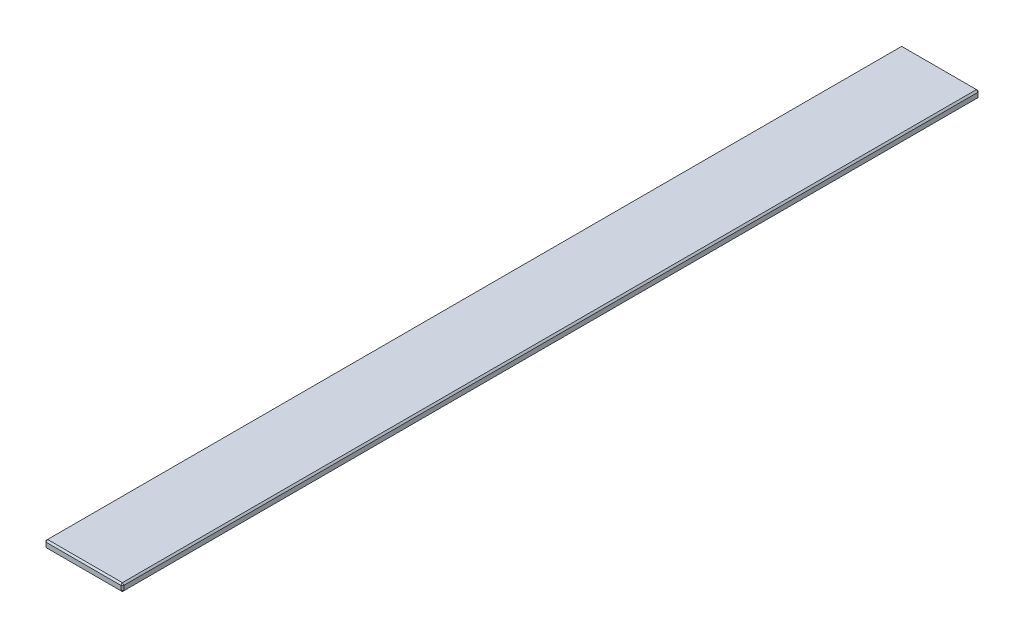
from build123d import *

# Parameters (mm, degrees)
ESQUISSE1_W        = 100
ESQUISSE1_H        = 10
BOSS_EXTRU_1_DEPTH = 550
CHANFREIN1_SIZE    = 2


with BuildPart() as part:
    # Esquisse1 → Boss.-Extru.1 (new, symmetric)
    with BuildSketch(Plane.XY):
        Rectangle(ESQUISSE1_W, ESQUISSE1_H)
    extrude(amount=BOSS_EXTRU_1_DEPTH, both=True)

    # Chanfrein1
    chanfrein1_edges = [part.edges().sort_by_distance(p)[0] for p in [
        (-50, 0, 550),
        (0, -5, 550),
        (50, 0, 550),
        (0, -5, -550),
        (-50, 0, -550),
        (0, 5, -550),
        (50, 0, -550),
        (0, 5, 550),
        (50, -5, 0),
        (-50, -5, 0),
        (-50, 5, 0),
        (50, 5, 0),
    ]]
    chamfer(chanfrein1_edges, length=CHANFREIN1_SIZE)


solid = part.part
